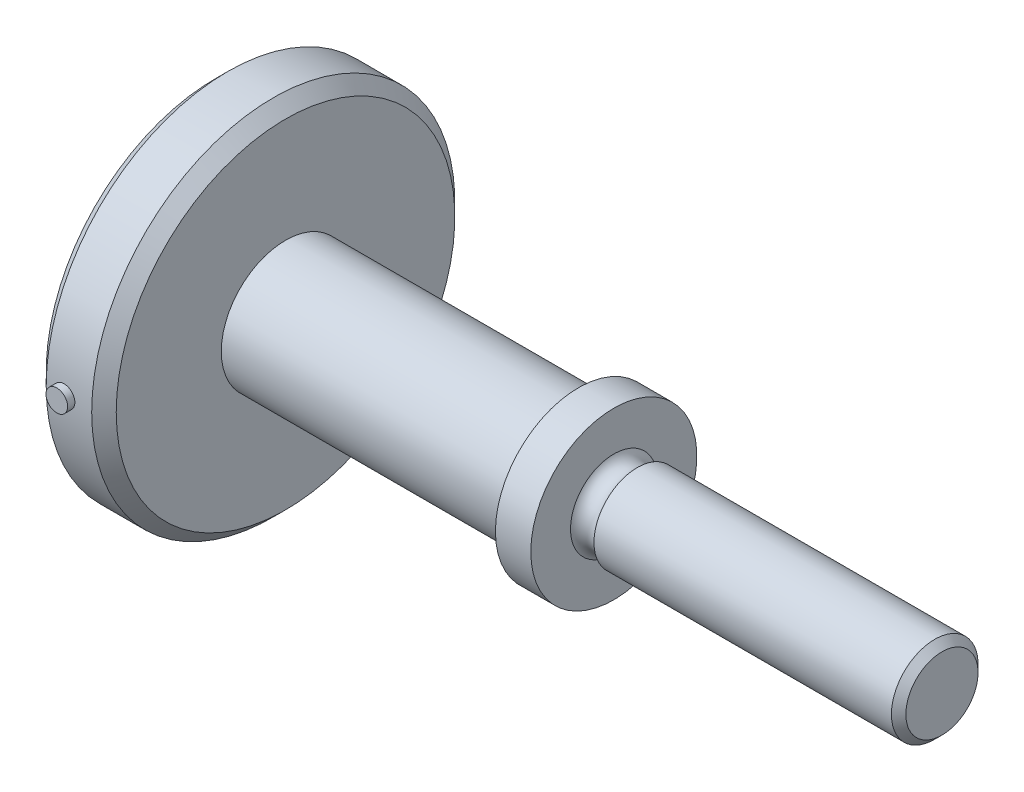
from build123d import *

# Parameters (mm, degrees)
CHAMFER1_SIZE       = 1.7
CHAMFER2_SIZE       = 1.7
CHAMFER3_SIZE       = 1
SKETCH2_R           = 1.5
BOSS_EXTRUDE1_DEPTH = 1


with BuildPart() as part:
    # Sketch1 → Revolve1 (revolve)
    with BuildSketch(Plane.XY, mode=Mode.PRIVATE) as revolve1_sk:
        with BuildLine():
            Line((0, 0), (0, 6))
            Line((0, 6), (-42.2, 6))
            ThreePointArc((-42.2, 6), (-43.825, 4.974193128), (-45.45, 6))
            Line((-45.45, 6), (-45.45, 8.9))
            Line((-45.45, 8.9), (-45.45, 11.5))
            Line((-45.45, 11.5), (-50.35, 11.5))
            Line((-50.35, 11.5), (-50.35, 8.9))
            Line((-50.35, 8.9), (-90.92, 8.9))
            Line((-90.92, 8.9), (-90.92, 25.15))
            Line((-90.92, 25.15), (-100.62, 25.15))
            Line((-100.62, 25.15), (-100.62, 0))
            Line((-100.62, 0), (0, 0))
        make_face()
    revolve(revolve1_sk.sketch.rotate(Axis((-100.62, 0, 0), (1, 0, 0)), 90), axis=Axis((-100.62, 0, 0), (1, 0, 0)))

    # Chamfer1
    chamfer1_edges = [part.edges().sort_by_distance(p)[0] for p in [
        (-100.62, 0, -25.15),
    ]]
    chamfer(chamfer1_edges, length=CHAMFER1_SIZE)

    # Chamfer2
    chamfer2_edges = [part.edges().sort_by_distance(p)[0] for p in [
        (-90.92, 0, -25.15),
    ]]
    chamfer(chamfer2_edges, length=CHAMFER2_SIZE)

    # Chamfer3
    chamfer3_edges = [part.edges().sort_by_distance(p)[0] for p in [
        (0, 0, -6),
    ]]
    chamfer(chamfer3_edges, length=CHAMFER3_SIZE)


with BuildPart() as body_2:
    # Sketch2 → Boss-Extrude1 (new body)
    with BuildSketch(Plane.XY.offset(25.15)):
        with Locations((-96.449554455, 0)):
            Circle(SKETCH2_R)
    extrude(amount=BOSS_EXTRUDE1_DEPTH)


solid = Compound([part.part, body_2.part])
